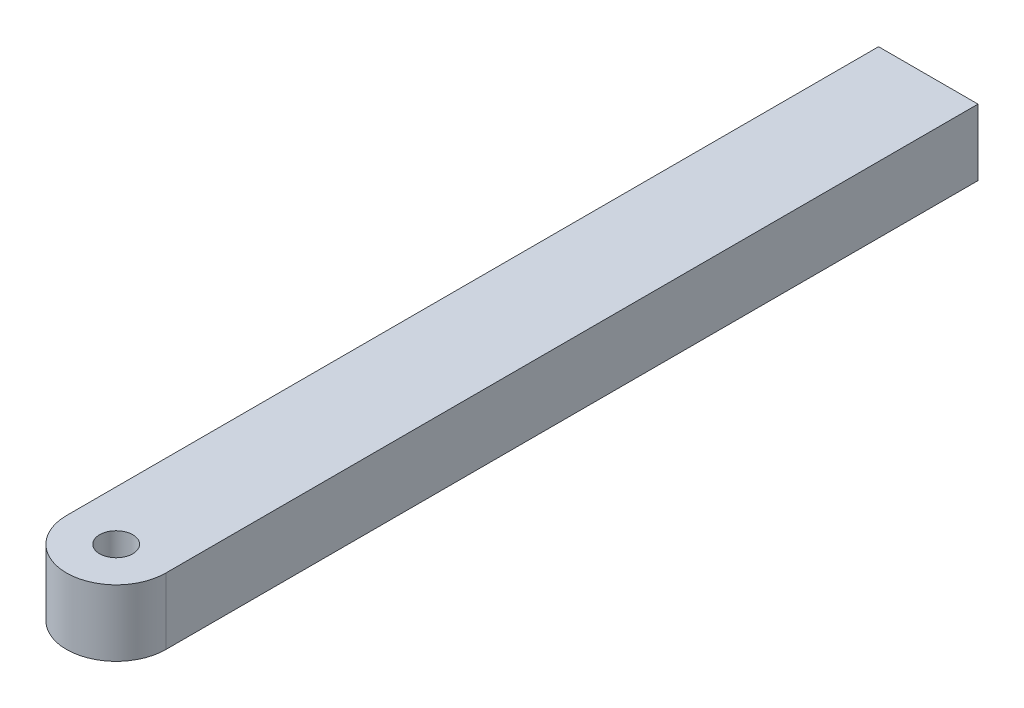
from build123d import *

# Parameters (mm, degrees)
SKETCH1_R      = 3.175
EXTRUDE1_DEPTH = 12.7


with BuildPart() as part:
    # Sketch1 → Extrude1 (new body)
    with BuildSketch(Plane.XZ):
        with BuildLine():
            Line((0, -9.525), (0, -165.1))
            Line((0, -165.1), (19.05, -165.1))
            Line((19.05, -165.1), (19.05, -9.525))
            ThreePointArc((19.05, -9.525), (9.525, 0), (0, -9.525))
        make_face()
        with Locations(Location((9.525, -9.525, 0), (0, 0, 90))):
            Circle(SKETCH1_R, mode=Mode.SUBTRACT)
    extrude(amount=-EXTRUDE1_DEPTH)


solid = part.part
